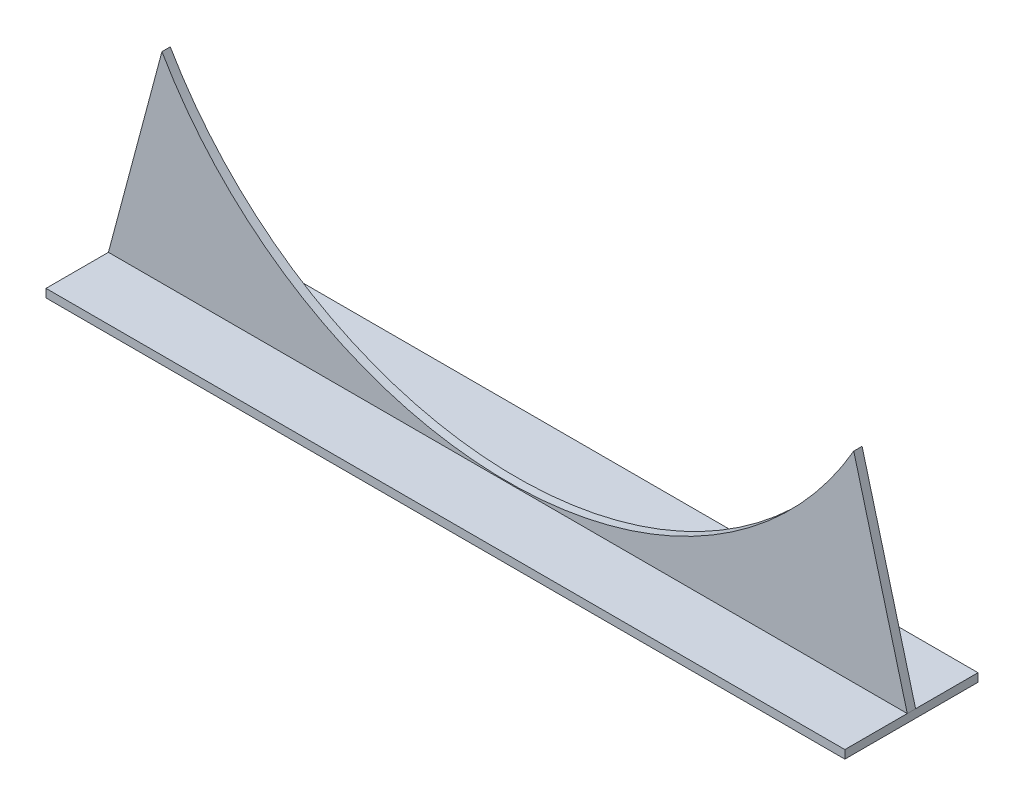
ISO-10303-21;
HEADER;
FILE_DESCRIPTION(('STEP AP214'),'2;1');
FILE_NAME('part.step','',(''),(''),'','','');
FILE_SCHEMA(('AUTOMOTIVE_DESIGN { 1 0 10303 214 1 1 1 1 }'));
ENDSEC;
DATA;
#1=APPLICATION_CONTEXT('core data for automotive mechanical design processes');
#2=APPLICATION_PROTOCOL_DEFINITION('international standard','automotive_design',2000,#1);
#3=PRODUCT_CONTEXT('',#1,'mechanical');
#4=PRODUCT('Part','Part','',(#3));
#5=PRODUCT_RELATED_PRODUCT_CATEGORY('part','',(#4));
#6=PRODUCT_DEFINITION_FORMATION('','',#4);
#7=PRODUCT_DEFINITION_CONTEXT('part definition',#1,'design');
#8=PRODUCT_DEFINITION('design','',#6,#7);
#9=PRODUCT_DEFINITION_SHAPE('','',#8);
#10=(LENGTH_UNIT() NAMED_UNIT(*) SI_UNIT(.MILLI.,.METRE.));
#11=(NAMED_UNIT(*) PLANE_ANGLE_UNIT() SI_UNIT($,.RADIAN.));
#12=(NAMED_UNIT(*) SI_UNIT($,.STERADIAN.) SOLID_ANGLE_UNIT());
#13=UNCERTAINTY_MEASURE_WITH_UNIT(LENGTH_MEASURE(1.E-05),#10,'distance_accuracy_value','');
#14=(GEOMETRIC_REPRESENTATION_CONTEXT(3) GLOBAL_UNCERTAINTY_ASSIGNED_CONTEXT((#13)) GLOBAL_UNIT_ASSIGNED_CONTEXT((#10,
#11,#12)) REPRESENTATION_CONTEXT('',''));
#15=CARTESIAN_POINT('',(0.,0.,0.));
#16=DIRECTION('',(0.,0.,1.));
#17=DIRECTION('',(1.,0.,0.));
#18=AXIS2_PLACEMENT_3D('',#15,#16,#17);
#19=CARTESIAN_POINT('',(0.,0.,6.35));
#20=DIRECTION('',(0.,0.,-1.));
#21=DIRECTION('',(-1.,0.,0.));
#22=AXIS2_PLACEMENT_3D('',#19,#20,#21);
#23=CYLINDRICAL_SURFACE('',#22,609.6);
#24=CARTESIAN_POINT('',(0.,0.,-6.35));
#25=DIRECTION('',(0.,0.,-1.));
#26=DIRECTION('',(-1.,0.,0.));
#27=AXIS2_PLACEMENT_3D('',#24,#25,#26);
#28=CIRCLE('',#27,609.6);
#29=CARTESIAN_POINT('',(527.929086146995,-304.799999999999,-6.35));
#30=VERTEX_POINT('',#29);
#31=CARTESIAN_POINT('',(-527.929086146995,-304.799999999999,-6.35));
#32=VERTEX_POINT('',#31);
#33=EDGE_CURVE('E96',#30,#32,#28,.T.);
#34=ORIENTED_EDGE('',*,*,#33,.T.);
#35=DIRECTION('',(0.,0.,-1.));
#36=VECTOR('',#35,1.);
#37=CARTESIAN_POINT('',(-527.929086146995,-304.799999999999,6.35));
#38=LINE('',#37,#36);
#39=CARTESIAN_POINT('',(-527.929086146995,-304.799999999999,6.35));
#40=VERTEX_POINT('',#39);
#41=EDGE_CURVE('E11',#40,#32,#38,.T.);
#42=ORIENTED_EDGE('',*,*,#41,.F.);
#43=CARTESIAN_POINT('',(0.,0.,6.35));
#44=DIRECTION('',(0.,0.,-1.));
#45=DIRECTION('',(-1.,0.,0.));
#46=AXIS2_PLACEMENT_3D('',#43,#44,#45);
#47=CIRCLE('',#46,609.6);
#48=CARTESIAN_POINT('',(527.929086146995,-304.799999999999,6.35));
#49=VERTEX_POINT('',#48);
#50=EDGE_CURVE('E88',#49,#40,#47,.T.);
#51=ORIENTED_EDGE('',*,*,#50,.F.);
#52=DIRECTION('',(0.,0.,-1.));
#53=VECTOR('',#52,1.);
#54=CARTESIAN_POINT('',(527.929086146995,-304.799999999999,6.35));
#55=LINE('',#54,#53);
#56=EDGE_CURVE('E97',#49,#30,#55,.T.);
#57=ORIENTED_EDGE('',*,*,#56,.T.);
#58=EDGE_LOOP('',(#34,#42,#51,#57));
#59=FACE_BOUND('',#58,.T.);
#60=ADVANCED_FACE('F33',(#59),#23,.F.);
#61=CARTESIAN_POINT('',(-527.929086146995,-304.799999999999,6.35));
#62=DIRECTION('',(0.966193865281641,-0.257816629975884,0.));
#63=DIRECTION('',(0.257816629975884,0.966193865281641,0.));
#64=AXIS2_PLACEMENT_3D('',#61,#62,#63);
#65=PLANE('',#64);
#66=DIRECTION('',(-0.257816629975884,-0.966193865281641,0.));
#67=VECTOR('',#66,1.);
#68=CARTESIAN_POINT('',(-527.929086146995,-304.799999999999,-6.35));
#69=LINE('',#68,#67);
#70=CARTESIAN_POINT('',(-609.6,-610.87,-6.34999999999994));
#71=VERTEX_POINT('',#70);
#72=EDGE_CURVE('E64',#32,#71,#69,.T.);
#73=ORIENTED_EDGE('',*,*,#72,.T.);
#74=DIRECTION('',(0.,0.,-1.));
#75=VECTOR('',#74,1.);
#76=CARTESIAN_POINT('',(-609.6,-610.87,6.35));
#77=LINE('',#76,#75);
#78=CARTESIAN_POINT('',(-609.6,-610.87,6.35000000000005));
#79=VERTEX_POINT('',#78);
#80=EDGE_CURVE('E42',#79,#71,#77,.T.);
#81=ORIENTED_EDGE('',*,*,#80,.F.);
#82=DIRECTION('',(-0.257816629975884,-0.966193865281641,0.));
#83=VECTOR('',#82,1.);
#84=CARTESIAN_POINT('',(-527.929086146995,-304.799999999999,6.35));
#85=LINE('',#84,#83);
#86=EDGE_CURVE('E82',#40,#79,#85,.T.);
#87=ORIENTED_EDGE('',*,*,#86,.F.);
#88=ORIENTED_EDGE('',*,*,#41,.T.);
#89=EDGE_LOOP('',(#73,#81,#87,#88));
#90=FACE_BOUND('',#89,.T.);
#91=ADVANCED_FACE('F83',(#90),#65,.F.);
#92=CARTESIAN_POINT('',(609.6,-610.87,6.35));
#93=DIRECTION('',(-0.966193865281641,-0.257816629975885,0.));
#94=DIRECTION('',(0.257816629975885,-0.966193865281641,0.));
#95=AXIS2_PLACEMENT_3D('',#92,#93,#94);
#96=PLANE('',#95);
#97=DIRECTION('',(-0.257816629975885,0.966193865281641,0.));
#98=VECTOR('',#97,1.);
#99=CARTESIAN_POINT('',(609.6,-610.87,-6.35));
#100=LINE('',#99,#98);
#101=CARTESIAN_POINT('',(609.6,-610.87,-6.34999999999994));
#102=VERTEX_POINT('',#101);
#103=EDGE_CURVE('E94',#102,#30,#100,.T.);
#104=ORIENTED_EDGE('',*,*,#103,.T.);
#105=ORIENTED_EDGE('',*,*,#56,.F.);
#106=DIRECTION('',(-0.257816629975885,0.966193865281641,0.));
#107=VECTOR('',#106,1.);
#108=CARTESIAN_POINT('',(609.6,-610.87,6.35));
#109=LINE('',#108,#107);
#110=CARTESIAN_POINT('',(609.6,-610.87,6.35));
#111=VERTEX_POINT('',#110);
#112=EDGE_CURVE('E51',#111,#49,#109,.T.);
#113=ORIENTED_EDGE('',*,*,#112,.F.);
#114=DIRECTION('',(0.,0.,-1.));
#115=VECTOR('',#114,1.);
#116=CARTESIAN_POINT('',(609.6,-610.87,6.35));
#117=LINE('',#116,#115);
#118=EDGE_CURVE('E116',#111,#102,#117,.T.);
#119=ORIENTED_EDGE('',*,*,#118,.T.);
#120=EDGE_LOOP('',(#104,#105,#113,#119));
#121=FACE_BOUND('',#120,.T.);
#122=ADVANCED_FACE('F115',(#121),#96,.F.);
#123=CARTESIAN_POINT('',(0.,0.,6.35));
#124=DIRECTION('',(0.,0.,-1.));
#125=DIRECTION('',(-1.,0.,0.));
#126=AXIS2_PLACEMENT_3D('',#123,#124,#125);
#127=PLANE('',#126);
#128=ORIENTED_EDGE('',*,*,#50,.T.);
#129=ORIENTED_EDGE('',*,*,#86,.T.);
#130=DIRECTION('',(1.,0.,0.));
#131=VECTOR('',#130,1.);
#132=CARTESIAN_POINT('',(-609.6,-610.87,6.35));
#133=LINE('',#132,#131);
#134=EDGE_CURVE('E87',#79,#111,#133,.T.);
#135=ORIENTED_EDGE('',*,*,#134,.T.);
#136=ORIENTED_EDGE('',*,*,#112,.T.);
#137=EDGE_LOOP('',(#128,#129,#135,#136));
#138=FACE_BOUND('',#137,.T.);
#139=ADVANCED_FACE('F91',(#138),#127,.F.);
#140=CARTESIAN_POINT('',(0.,0.,-6.35));
#141=DIRECTION('',(0.,0.,-1.));
#142=DIRECTION('',(-1.,0.,0.));
#143=AXIS2_PLACEMENT_3D('',#140,#141,#142);
#144=PLANE('',#143);
#145=ORIENTED_EDGE('',*,*,#33,.F.);
#146=ORIENTED_EDGE('',*,*,#103,.F.);
#147=DIRECTION('',(1.,0.,0.));
#148=VECTOR('',#147,1.);
#149=CARTESIAN_POINT('',(-609.6,-610.87,-6.35));
#150=LINE('',#149,#148);
#151=EDGE_CURVE('E72',#71,#102,#150,.T.);
#152=ORIENTED_EDGE('',*,*,#151,.F.);
#153=ORIENTED_EDGE('',*,*,#72,.F.);
#154=EDGE_LOOP('',(#145,#146,#152,#153));
#155=FACE_BOUND('',#154,.T.);
#156=ADVANCED_FACE('F117',(#155),#144,.T.);
#157=CARTESIAN_POINT('',(609.6,-610.87,101.6));
#158=DIRECTION('',(0.,-1.,0.));
#159=DIRECTION('',(0.,0.,-1.));
#160=AXIS2_PLACEMENT_3D('',#157,#158,#159);
#161=PLANE('',#160);
#162=DIRECTION('',(0.,0.,1.));
#163=VECTOR('',#162,1.);
#164=CARTESIAN_POINT('',(-609.6,-610.87,101.6));
#165=LINE('',#164,#163);
#166=CARTESIAN_POINT('',(-609.6,-610.87,-101.6));
#167=VERTEX_POINT('',#166);
#168=EDGE_CURVE('E165',#167,#71,#165,.T.);
#169=ORIENTED_EDGE('',*,*,#168,.T.);
#170=ORIENTED_EDGE('',*,*,#151,.T.);
#171=DIRECTION('',(0.,0.,1.));
#172=VECTOR('',#171,1.);
#173=CARTESIAN_POINT('',(609.6,-610.87,101.6));
#174=LINE('',#173,#172);
#175=CARTESIAN_POINT('',(609.6,-610.87,-101.6));
#176=VERTEX_POINT('',#175);
#177=EDGE_CURVE('E192',#176,#102,#174,.T.);
#178=ORIENTED_EDGE('',*,*,#177,.F.);
#179=DIRECTION('',(-1.,0.,0.));
#180=VECTOR('',#179,1.);
#181=CARTESIAN_POINT('',(609.6,-610.87,-101.6));
#182=LINE('',#181,#180);
#183=EDGE_CURVE('E189',#176,#167,#182,.T.);
#184=ORIENTED_EDGE('',*,*,#183,.T.);
#185=EDGE_LOOP('',(#169,#170,#178,#184));
#186=FACE_BOUND('',#185,.T.);
#187=ADVANCED_FACE('F197',(#186),#161,.F.);
#188=CARTESIAN_POINT('',(609.6,-610.87,101.6));
#189=DIRECTION('',(0.,0.,-1.));
#190=DIRECTION('',(0.,1.,0.));
#191=AXIS2_PLACEMENT_3D('',#188,#189,#190);
#192=PLANE('',#191);
#193=DIRECTION('',(0.,-1.,0.));
#194=VECTOR('',#193,1.);
#195=CARTESIAN_POINT('',(-609.6,-610.87,101.6));
#196=LINE('',#195,#194);
#197=CARTESIAN_POINT('',(-609.6,-610.87,101.6));
#198=VERTEX_POINT('',#197);
#199=CARTESIAN_POINT('',(-609.6,-623.57,101.6));
#200=VERTEX_POINT('',#199);
#201=EDGE_CURVE('E169',#198,#200,#196,.T.);
#202=ORIENTED_EDGE('',*,*,#201,.T.);
#203=DIRECTION('',(-1.,0.,0.));
#204=VECTOR('',#203,1.);
#205=CARTESIAN_POINT('',(609.6,-623.57,101.6));
#206=LINE('',#205,#204);
#207=CARTESIAN_POINT('',(609.6,-623.57,101.6));
#208=VERTEX_POINT('',#207);
#209=EDGE_CURVE('E99',#208,#200,#206,.T.);
#210=ORIENTED_EDGE('',*,*,#209,.F.);
#211=DIRECTION('',(0.,-1.,0.));
#212=VECTOR('',#211,1.);
#213=CARTESIAN_POINT('',(609.6,-610.87,101.6));
#214=LINE('',#213,#212);
#215=CARTESIAN_POINT('',(609.6,-610.87,101.6));
#216=VERTEX_POINT('',#215);
#217=EDGE_CURVE('E156',#216,#208,#214,.T.);
#218=ORIENTED_EDGE('',*,*,#217,.F.);
#219=DIRECTION('',(-1.,0.,0.));
#220=VECTOR('',#219,1.);
#221=CARTESIAN_POINT('',(609.6,-610.87,101.6));
#222=LINE('',#221,#220);
#223=EDGE_CURVE('E170',#216,#198,#222,.T.);
#224=ORIENTED_EDGE('',*,*,#223,.T.);
#225=EDGE_LOOP('',(#202,#210,#218,#224));
#226=FACE_BOUND('',#225,.T.);
#227=ADVANCED_FACE('F167',(#226),#192,.F.);
#228=CARTESIAN_POINT('',(609.6,-623.57,101.6));
#229=DIRECTION('',(0.,1.,0.));
#230=DIRECTION('',(0.,0.,1.));
#231=AXIS2_PLACEMENT_3D('',#228,#229,#230);
#232=PLANE('',#231);
#233=DIRECTION('',(0.,0.,-1.));
#234=VECTOR('',#233,1.);
#235=CARTESIAN_POINT('',(-609.6,-623.57,101.6));
#236=LINE('',#235,#234);
#237=CARTESIAN_POINT('',(-609.6,-623.57,-101.6));
#238=VERTEX_POINT('',#237);
#239=EDGE_CURVE('E171',#200,#238,#236,.T.);
#240=ORIENTED_EDGE('',*,*,#239,.T.);
#241=DIRECTION('',(-1.,0.,0.));
#242=VECTOR('',#241,1.);
#243=CARTESIAN_POINT('',(609.6,-623.57,-101.6));
#244=LINE('',#243,#242);
#245=CARTESIAN_POINT('',(609.6,-623.57,-101.6));
#246=VERTEX_POINT('',#245);
#247=EDGE_CURVE('E103',#246,#238,#244,.T.);
#248=ORIENTED_EDGE('',*,*,#247,.F.);
#249=DIRECTION('',(0.,0.,-1.));
#250=VECTOR('',#249,1.);
#251=CARTESIAN_POINT('',(609.6,-623.57,101.6));
#252=LINE('',#251,#250);
#253=EDGE_CURVE('E147',#208,#246,#252,.T.);
#254=ORIENTED_EDGE('',*,*,#253,.F.);
#255=ORIENTED_EDGE('',*,*,#209,.T.);
#256=EDGE_LOOP('',(#240,#248,#254,#255));
#257=FACE_BOUND('',#256,.T.);
#258=ADVANCED_FACE('F149',(#257),#232,.F.);
#259=CARTESIAN_POINT('',(609.6,-610.87,-101.6));
#260=DIRECTION('',(0.,0.,1.));
#261=DIRECTION('',(0.,-1.,0.));
#262=AXIS2_PLACEMENT_3D('',#259,#260,#261);
#263=PLANE('',#262);
#264=DIRECTION('',(0.,1.,0.));
#265=VECTOR('',#264,1.);
#266=CARTESIAN_POINT('',(-609.6,-610.87,-101.6));
#267=LINE('',#266,#265);
#268=EDGE_CURVE('E173',#238,#167,#267,.T.);
#269=ORIENTED_EDGE('',*,*,#268,.T.);
#270=ORIENTED_EDGE('',*,*,#183,.F.);
#271=DIRECTION('',(0.,1.,0.));
#272=VECTOR('',#271,1.);
#273=CARTESIAN_POINT('',(609.6,-610.87,-101.6));
#274=LINE('',#273,#272);
#275=EDGE_CURVE('E155',#246,#176,#274,.T.);
#276=ORIENTED_EDGE('',*,*,#275,.F.);
#277=ORIENTED_EDGE('',*,*,#247,.T.);
#278=EDGE_LOOP('',(#269,#270,#276,#277));
#279=FACE_BOUND('',#278,.T.);
#280=ADVANCED_FACE('F195',(#279),#263,.F.);
#281=ORIENTED_EDGE('',*,*,#134,.F.);
#282=EDGE_CURVE('E180',#79,#198,#165,.T.);
#283=ORIENTED_EDGE('',*,*,#282,.T.);
#284=ORIENTED_EDGE('',*,*,#223,.F.);
#285=EDGE_CURVE('E161',#111,#216,#174,.T.);
#286=ORIENTED_EDGE('',*,*,#285,.F.);
#287=EDGE_LOOP('',(#281,#283,#284,#286));
#288=FACE_BOUND('',#287,.T.);
#289=ADVANCED_FACE('F200',(#288),#161,.F.);
#290=CARTESIAN_POINT('',(609.6,0.,0.));
#291=DIRECTION('',(1.,0.,0.));
#292=DIRECTION('',(0.,0.,-1.));
#293=AXIS2_PLACEMENT_3D('',#290,#291,#292);
#294=PLANE('',#293);
#295=ORIENTED_EDGE('',*,*,#217,.T.);
#296=ORIENTED_EDGE('',*,*,#253,.T.);
#297=ORIENTED_EDGE('',*,*,#275,.T.);
#298=ORIENTED_EDGE('',*,*,#177,.T.);
#299=ORIENTED_EDGE('',*,*,#118,.F.);
#300=ORIENTED_EDGE('',*,*,#285,.T.);
#301=EDGE_LOOP('',(#295,#296,#297,#298,#299,#300));
#302=FACE_BOUND('',#301,.T.);
#303=ADVANCED_FACE('F159',(#302),#294,.T.);
#304=CARTESIAN_POINT('',(-609.6,0.,0.));
#305=DIRECTION('',(1.,0.,0.));
#306=DIRECTION('',(0.,0.,-1.));
#307=AXIS2_PLACEMENT_3D('',#304,#305,#306);
#308=PLANE('',#307);
#309=ORIENTED_EDGE('',*,*,#201,.F.);
#310=ORIENTED_EDGE('',*,*,#282,.F.);
#311=ORIENTED_EDGE('',*,*,#80,.T.);
#312=ORIENTED_EDGE('',*,*,#168,.F.);
#313=ORIENTED_EDGE('',*,*,#268,.F.);
#314=ORIENTED_EDGE('',*,*,#239,.F.);
#315=EDGE_LOOP('',(#309,#310,#311,#312,#313,#314));
#316=FACE_BOUND('',#315,.T.);
#317=ADVANCED_FACE('F238',(#316),#308,.F.);
#318=CLOSED_SHELL('',(#60,#91,#122,#139,#156,#187,#227,#258,#280,#289,#303,#317));
#319=MANIFOLD_SOLID_BREP('B2',#318);
#320=ADVANCED_BREP_SHAPE_REPRESENTATION('',(#18,#319),#14);
#321=SHAPE_DEFINITION_REPRESENTATION(#9,#320);
ENDSEC;
END-ISO-10303-21;
